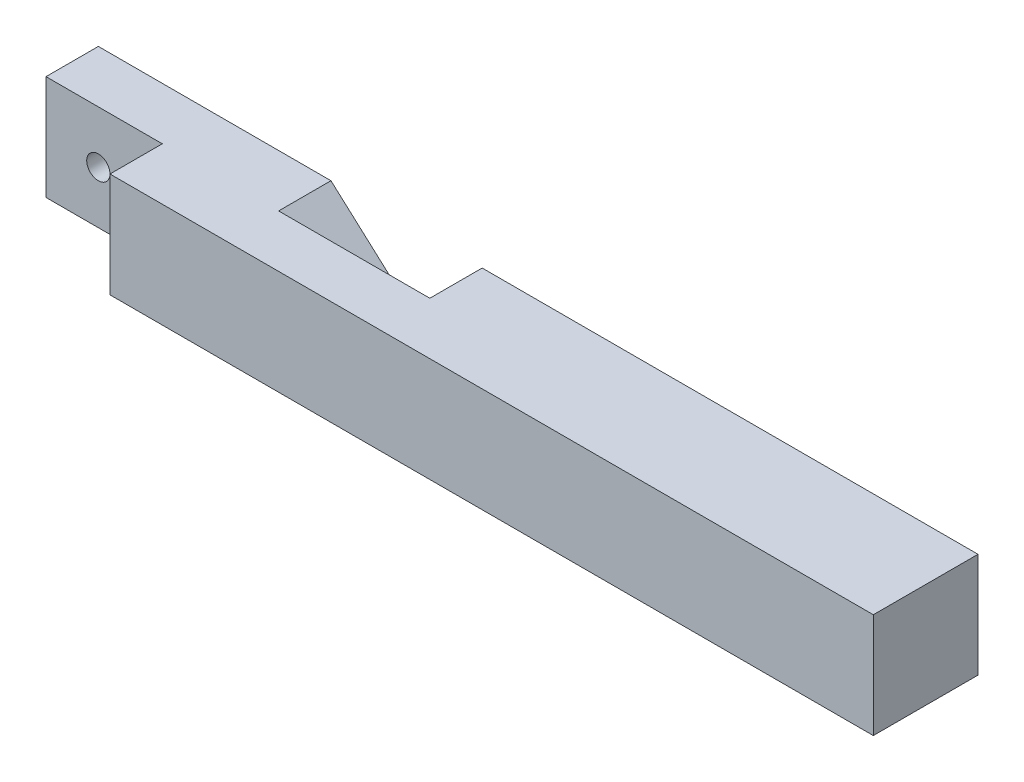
from build123d import *

# Parameters (mm, degrees)
ESQUISSE1_W             = 75.63
ESQUISSE1_H             = 9
EXTRUSION1_DEPTH        = 9
ESQUISSE2_W             = 10
ESQUISSE2_H             = 9
ENL_V_MAT_EXTRU_1_DEPTH = 4.5
ESQUISSE3_R             = 1
ENL_V_MAT_EXTRU_2_DEPTH = 4.5
ENL_V_MAT_EXTRU_3_DEPTH = 4.5


with BuildPart() as part:
    # Esquisse1 → Extrusion1 (new body)
    with BuildSketch(Plane.XY):
        with Locations((37.815, 4.5)):
            Rectangle(ESQUISSE1_W, ESQUISSE1_H)
    extrude(amount=EXTRUSION1_DEPTH)

    # Esquisse2 → Enl_v. mat.-Extru.1 (cut)
    with BuildSketch(Plane.XY.offset(9)):
        with Locations((5, 4.5)):
            Rectangle(ESQUISSE2_W, ESQUISSE2_H)
    extrude(amount=-ENL_V_MAT_EXTRU_1_DEPTH, mode=Mode.SUBTRACT)

    # Esquisse3 → Enl_v. mat.-Extru.2 (cut)
    with BuildSketch(Plane.XY.offset(4.5)):
        with Locations((4.5, 4.5)):
            Circle(ESQUISSE3_R)
    extrude(amount=-ENL_V_MAT_EXTRU_2_DEPTH, mode=Mode.SUBTRACT)

    # Esquisse4 → Enl_v. mat.-Extru.3 (cut)
    with BuildSketch(Plane(origin=(0, 0, 0), x_dir=(-1, 0, 0), z_dir=(0, 0, -1))):
        Polygon((-20, 9), (-30, 0), (-43, 0), (-33, 9), align=None)
    extrude(amount=-ENL_V_MAT_EXTRU_3_DEPTH, mode=Mode.SUBTRACT)


solid = part.part
